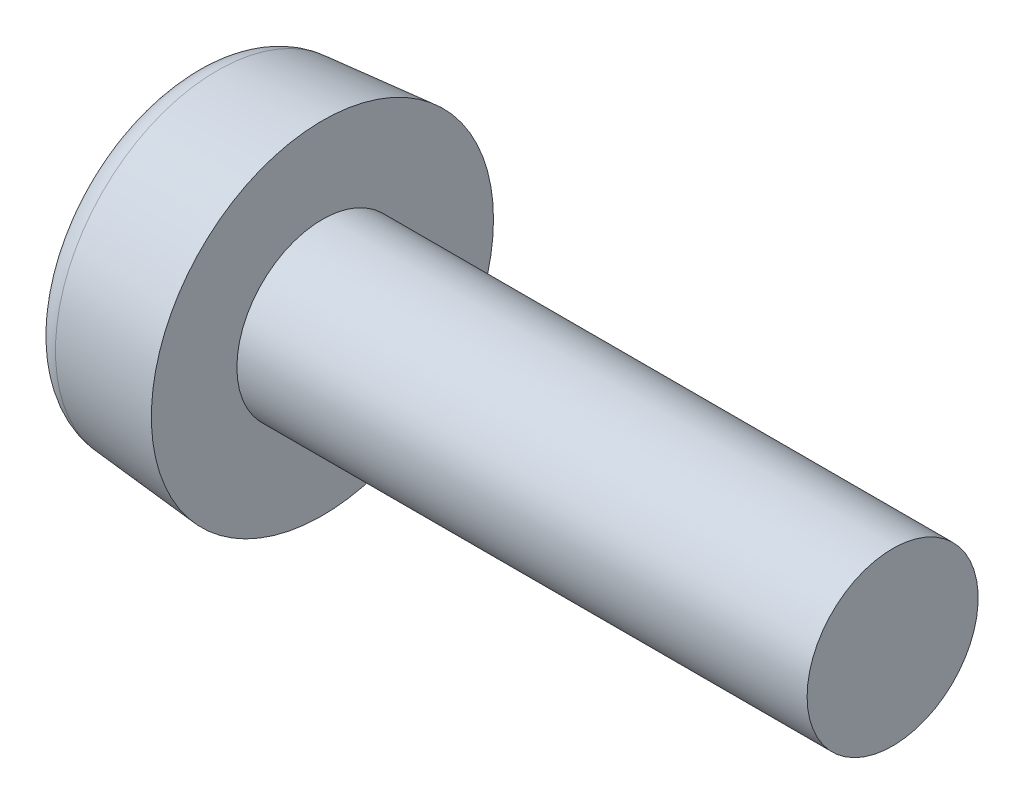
ISO-10303-21;
HEADER;
FILE_DESCRIPTION(('STEP AP214'),'2;1');
FILE_NAME('part.step','',(''),(''),'','','');
FILE_SCHEMA(('AUTOMOTIVE_DESIGN { 1 0 10303 214 1 1 1 1 }'));
ENDSEC;
DATA;
#1=APPLICATION_CONTEXT('core data for automotive mechanical design processes');
#2=APPLICATION_PROTOCOL_DEFINITION('international standard','automotive_design',2000,#1);
#3=PRODUCT_CONTEXT('',#1,'mechanical');
#4=PRODUCT('Part','Part','',(#3));
#5=PRODUCT_RELATED_PRODUCT_CATEGORY('part','',(#4));
#6=PRODUCT_DEFINITION_FORMATION('','',#4);
#7=PRODUCT_DEFINITION_CONTEXT('part definition',#1,'design');
#8=PRODUCT_DEFINITION('design','',#6,#7);
#9=PRODUCT_DEFINITION_SHAPE('','',#8);
#10=(LENGTH_UNIT() NAMED_UNIT(*) SI_UNIT(.MILLI.,.METRE.));
#11=(NAMED_UNIT(*) PLANE_ANGLE_UNIT() SI_UNIT($,.RADIAN.));
#12=(NAMED_UNIT(*) SI_UNIT($,.STERADIAN.) SOLID_ANGLE_UNIT());
#13=UNCERTAINTY_MEASURE_WITH_UNIT(LENGTH_MEASURE(1.E-05),#10,'distance_accuracy_value','');
#14=(GEOMETRIC_REPRESENTATION_CONTEXT(3) GLOBAL_UNCERTAINTY_ASSIGNED_CONTEXT((#13)) GLOBAL_UNIT_ASSIGNED_CONTEXT((#10,
#11,#12)) REPRESENTATION_CONTEXT('',''));
#15=CARTESIAN_POINT('',(0.,0.,0.));
#16=DIRECTION('',(0.,0.,1.));
#17=DIRECTION('',(1.,0.,0.));
#18=AXIS2_PLACEMENT_3D('',#15,#16,#17);
#19=CARTESIAN_POINT('',(0.,0.,0.));
#20=DIRECTION('',(1.,0.,0.));
#21=DIRECTION('',(0.,0.,-1.));
#22=AXIS2_PLACEMENT_3D('',#19,#20,#21);
#23=PLANE('',#22);
#24=CARTESIAN_POINT('',(0.,0.,0.));
#25=DIRECTION('',(1.,0.,0.));
#26=DIRECTION('',(0.,0.,-1.));
#27=AXIS2_PLACEMENT_3D('',#24,#25,#26);
#28=CIRCLE('',#27,4.68122097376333);
#29=CARTESIAN_POINT('',(0.,0.,-4.68122097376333));
#30=VERTEX_POINT('',#29);
#31=EDGE_CURVE('E12',#30,#30,#28,.F.);
#32=ORIENTED_EDGE('',*,*,#31,.T.);
#33=EDGE_LOOP('',(#32));
#34=FACE_BOUND('',#33,.T.);
#35=CARTESIAN_POINT('',(0.,1.73205080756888,-1.));
#36=CARTESIAN_POINT('',(0.,1.95410860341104,-0.615384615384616));
#37=CARTESIAN_POINT('',(0.,2.66469355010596,0.));
#38=CARTESIAN_POINT('',(0.,1.59881613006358,0.923076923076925));
#39=CARTESIAN_POINT('',(0.,1.33234677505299,2.30769230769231));
#40=CARTESIAN_POINT('',(0.,0.,1.84615384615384));
#41=CARTESIAN_POINT('',(0.,-1.33234677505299,2.30769230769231));
#42=CARTESIAN_POINT('',(0.,-1.59881613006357,0.923076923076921));
#43=CARTESIAN_POINT('',(0.,-2.66469355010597,0.));
#44=CARTESIAN_POINT('',(0.,-1.59881613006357,-0.923076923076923));
#45=CARTESIAN_POINT('',(0.,-1.33234677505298,-2.30769230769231));
#46=CARTESIAN_POINT('',(0.,0.,-1.84615384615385));
#47=CARTESIAN_POINT('',(0.,1.33234677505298,-2.30769230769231));
#48=CARTESIAN_POINT('',(0.,1.50999301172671,-1.38461538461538));
#49=CARTESIAN_POINT('',(0.,1.73205080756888,-1.));
#50=B_SPLINE_CURVE_WITH_KNOTS('',3,(#35,#36,#37,#38,#39,#40,#41,#42,#43,#44,#45,#46,#47,#48,
#49),.UNSPECIFIED.,.T.,.F.,(4,1,1,1,1,1,1,1,1,1,1,1,4),(0.,0.0833333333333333,0.166666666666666,
0.25,0.333333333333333,0.416666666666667,0.5,0.583333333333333,0.666666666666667,0.75,
0.833333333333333,0.916666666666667,1.),.UNSPECIFIED.);
#51=CARTESIAN_POINT('',(0.,1.73205080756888,-1.));
#52=VERTEX_POINT('',#51);
#53=EDGE_CURVE('E62',#52,#52,#50,.T.);
#54=ORIENTED_EDGE('',*,*,#53,.T.);
#55=EDGE_LOOP('',(#54));
#56=FACE_BOUND('',#55,.T.);
#57=ADVANCED_FACE('F43',(#34,#56),#23,.F.);
#58=CARTESIAN_POINT('',(4.6,0.,0.));
#59=DIRECTION('',(1.,0.,0.));
#60=DIRECTION('',(0.,0.,-1.));
#61=AXIS2_PLACEMENT_3D('',#58,#59,#60);
#62=PLANE('',#61);
#63=CARTESIAN_POINT('',(4.6,0.,0.));
#64=DIRECTION('',(1.,0.,0.));
#65=DIRECTION('',(0.,0.,-1.));
#66=AXIS2_PLACEMENT_3D('',#63,#64,#65);
#67=CIRCLE('',#66,6.);
#68=CARTESIAN_POINT('',(4.6,0.,-6.));
#69=VERTEX_POINT('',#68);
#70=EDGE_CURVE('E111',#69,#69,#67,.T.);
#71=ORIENTED_EDGE('',*,*,#70,.T.);
#72=EDGE_LOOP('',(#71));
#73=FACE_BOUND('',#72,.T.);
#74=CARTESIAN_POINT('',(4.6,0.,0.));
#75=DIRECTION('',(-1.,0.,0.));
#76=DIRECTION('',(0.,0.,1.));
#77=AXIS2_PLACEMENT_3D('',#74,#75,#76);
#78=CIRCLE('',#77,3.);
#79=CARTESIAN_POINT('',(4.6,0.,3.));
#80=VERTEX_POINT('',#79);
#81=EDGE_CURVE('E65',#80,#80,#78,.T.);
#82=ORIENTED_EDGE('',*,*,#81,.T.);
#83=EDGE_LOOP('',(#82));
#84=FACE_BOUND('',#83,.T.);
#85=ADVANCED_FACE('F98',(#73,#84),#62,.T.);
#86=CARTESIAN_POINT('',(4.6,0.,0.));
#87=DIRECTION('',(1.,0.,0.));
#88=DIRECTION('',(0.,0.,-1.));
#89=AXIS2_PLACEMENT_3D('',#86,#87,#88);
#90=CONICAL_SURFACE('',#89,6.,0.0872664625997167);
#91=CARTESIAN_POINT('',(0.912844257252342,0.,0.));
#92=DIRECTION('',(1.,0.,0.));
#93=DIRECTION('',(0.,0.,-1.));
#94=AXIS2_PLACEMENT_3D('',#91,#92,#93);
#95=CIRCLE('',#94,5.67741567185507);
#96=CARTESIAN_POINT('',(0.912844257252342,0.,-5.67741567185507));
#97=VERTEX_POINT('',#96);
#98=EDGE_CURVE('E50',#97,#97,#95,.T.);
#99=ORIENTED_EDGE('',*,*,#98,.T.);
#100=EDGE_LOOP('',(#99));
#101=FACE_BOUND('',#100,.T.);
#102=ORIENTED_EDGE('',*,*,#70,.F.);
#103=EDGE_LOOP('',(#102));
#104=FACE_BOUND('',#103,.T.);
#105=ADVANCED_FACE('F94',(#101,#104),#90,.T.);
#106=CARTESIAN_POINT('',(24.6,3.,0.));
#107=DIRECTION('',(-1.,0.,0.));
#108=DIRECTION('',(0.,0.,1.));
#109=AXIS2_PLACEMENT_3D('',#106,#107,#108);
#110=PLANE('',#109);
#111=CARTESIAN_POINT('',(24.6,0.,0.));
#112=DIRECTION('',(-1.,0.,0.));
#113=DIRECTION('',(0.,0.,1.));
#114=AXIS2_PLACEMENT_3D('',#111,#112,#113);
#115=CIRCLE('',#114,3.);
#116=CARTESIAN_POINT('',(24.6,0.,3.));
#117=VERTEX_POINT('',#116);
#118=EDGE_CURVE('E113',#117,#117,#115,.T.);
#119=ORIENTED_EDGE('',*,*,#118,.F.);
#120=EDGE_LOOP('',(#119));
#121=FACE_BOUND('',#120,.T.);
#122=ADVANCED_FACE('F90',(#121),#110,.F.);
#123=CARTESIAN_POINT('',(0.,0.,0.));
#124=DIRECTION('',(-1.,0.,0.));
#125=DIRECTION('',(0.,0.,1.));
#126=AXIS2_PLACEMENT_3D('',#123,#124,#125);
#127=CYLINDRICAL_SURFACE('',#126,3.);
#128=ORIENTED_EDGE('',*,*,#81,.F.);
#129=EDGE_LOOP('',(#128));
#130=FACE_BOUND('',#129,.T.);
#131=ORIENTED_EDGE('',*,*,#118,.T.);
#132=EDGE_LOOP('',(#131));
#133=FACE_BOUND('',#132,.T.);
#134=ADVANCED_FACE('F85',(#130,#133),#127,.T.);
#135=CARTESIAN_POINT('',(2.,1.73205080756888,-1.));
#136=CARTESIAN_POINT('',(2.,1.95410860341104,-0.615384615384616));
#137=CARTESIAN_POINT('',(2.,2.66469355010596,0.));
#138=CARTESIAN_POINT('',(2.,1.59881613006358,0.923076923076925));
#139=CARTESIAN_POINT('',(2.,1.33234677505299,2.30769230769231));
#140=CARTESIAN_POINT('',(2.,0.,1.84615384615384));
#141=CARTESIAN_POINT('',(2.,-1.33234677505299,2.30769230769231));
#142=CARTESIAN_POINT('',(2.,-1.59881613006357,0.923076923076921));
#143=CARTESIAN_POINT('',(2.,-2.66469355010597,0.));
#144=CARTESIAN_POINT('',(2.,-1.59881613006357,-0.923076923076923));
#145=CARTESIAN_POINT('',(2.,-1.33234677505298,-2.30769230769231));
#146=CARTESIAN_POINT('',(2.,0.,-1.84615384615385));
#147=CARTESIAN_POINT('',(2.,1.33234677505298,-2.30769230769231));
#148=CARTESIAN_POINT('',(2.,1.50999301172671,-1.38461538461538));
#149=CARTESIAN_POINT('',(2.,1.73205080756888,-1.));
#150=B_SPLINE_CURVE_WITH_KNOTS('',3,(#135,#136,#137,#138,#139,#140,#141,#142,#143,#144,#145,
#146,#147,#148,#149),.UNSPECIFIED.,.T.,.F.,(4,1,1,1,1,1,1,1,1,1,1,1,4),(0.,0.0833333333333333,
0.166666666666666,0.25,0.333333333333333,0.416666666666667,0.5,0.583333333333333,
0.666666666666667,0.75,0.833333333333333,0.916666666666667,1.),.UNSPECIFIED.);
#151=DIRECTION('',(-1.,0.,0.));
#152=VECTOR('',#151,1.);
#153=SURFACE_OF_LINEAR_EXTRUSION('',#150,#152);
#154=CARTESIAN_POINT('',(2.,1.73205080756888,-1.));
#155=CARTESIAN_POINT('',(2.,1.50999301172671,-1.38461538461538));
#156=CARTESIAN_POINT('',(2.,1.33234677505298,-2.30769230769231));
#157=CARTESIAN_POINT('',(2.,0.,-1.84615384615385));
#158=CARTESIAN_POINT('',(2.,-1.33234677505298,-2.30769230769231));
#159=CARTESIAN_POINT('',(2.,-1.59881613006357,-0.923076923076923));
#160=CARTESIAN_POINT('',(2.,-2.66469355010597,0.));
#161=CARTESIAN_POINT('',(2.,-1.59881613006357,0.923076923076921));
#162=CARTESIAN_POINT('',(2.,-1.33234677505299,2.30769230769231));
#163=CARTESIAN_POINT('',(2.,0.,1.84615384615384));
#164=CARTESIAN_POINT('',(2.,1.33234677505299,2.30769230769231));
#165=CARTESIAN_POINT('',(2.,1.59881613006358,0.923076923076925));
#166=CARTESIAN_POINT('',(2.,2.66469355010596,0.));
#167=CARTESIAN_POINT('',(2.,1.95410860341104,-0.615384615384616));
#168=CARTESIAN_POINT('',(2.,1.73205080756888,-1.));
#169=B_SPLINE_CURVE_WITH_KNOTS('',3,(#154,#155,#156,#157,#158,#159,#160,#161,#162,#163,#164,
#165,#166,#167,#168),.UNSPECIFIED.,.T.,.F.,(4,1,1,1,1,1,1,1,1,1,1,1,4),(0.,0.0833333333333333,
0.166666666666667,0.25,0.333333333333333,0.416666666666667,0.5,0.583333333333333,
0.666666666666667,0.75,0.833333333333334,0.916666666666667,1.),.UNSPECIFIED.);
#170=CARTESIAN_POINT('',(2.,1.73205080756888,-1.));
#171=VERTEX_POINT('',#170);
#172=EDGE_CURVE('E60',#171,#171,#169,.T.);
#173=ORIENTED_EDGE('',*,*,#172,.F.);
#174=EDGE_LOOP('',(#173));
#175=FACE_BOUND('',#174,.T.);
#176=ORIENTED_EDGE('',*,*,#53,.F.);
#177=EDGE_LOOP('',(#176));
#178=FACE_BOUND('',#177,.T.);
#179=ADVANCED_FACE('F56',(#175,#178),#153,.T.);
#180=CARTESIAN_POINT('',(2.66666666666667,0.,0.));
#181=CARTESIAN_POINT('',(2.,1.73205080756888,-1.));
#182=CARTESIAN_POINT('',(2.66666666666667,0.,0.));
#183=CARTESIAN_POINT('',(2.,1.50999301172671,-1.38461538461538));
#184=CARTESIAN_POINT('',(2.66666666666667,0.,0.));
#185=CARTESIAN_POINT('',(2.,1.33234677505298,-2.30769230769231));
#186=CARTESIAN_POINT('',(2.66666666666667,0.,0.));
#187=CARTESIAN_POINT('',(2.,0.,-1.84615384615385));
#188=CARTESIAN_POINT('',(2.66666666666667,0.,0.));
#189=CARTESIAN_POINT('',(2.,-1.33234677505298,-2.30769230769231));
#190=CARTESIAN_POINT('',(2.66666666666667,0.,0.));
#191=CARTESIAN_POINT('',(2.,-1.59881613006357,-0.923076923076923));
#192=CARTESIAN_POINT('',(2.66666666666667,0.,0.));
#193=CARTESIAN_POINT('',(2.,-2.66469355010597,0.));
#194=CARTESIAN_POINT('',(2.66666666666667,0.,0.));
#195=CARTESIAN_POINT('',(2.,-1.59881613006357,0.923076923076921));
#196=CARTESIAN_POINT('',(2.66666666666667,0.,0.));
#197=CARTESIAN_POINT('',(2.,-1.33234677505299,2.30769230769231));
#198=CARTESIAN_POINT('',(2.66666666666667,0.,0.));
#199=CARTESIAN_POINT('',(2.,0.,1.84615384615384));
#200=CARTESIAN_POINT('',(2.66666666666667,0.,0.));
#201=CARTESIAN_POINT('',(2.,1.33234677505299,2.30769230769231));
#202=CARTESIAN_POINT('',(2.66666666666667,0.,0.));
#203=CARTESIAN_POINT('',(2.,1.59881613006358,0.923076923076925));
#204=CARTESIAN_POINT('',(2.66666666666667,0.,0.));
#205=CARTESIAN_POINT('',(2.,2.66469355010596,0.));
#206=CARTESIAN_POINT('',(2.66666666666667,0.,0.));
#207=CARTESIAN_POINT('',(2.,1.95410860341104,-0.615384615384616));
#208=CARTESIAN_POINT('',(2.66666666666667,0.,0.));
#209=CARTESIAN_POINT('',(2.,1.73205080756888,-1.));
#210=B_SPLINE_SURFACE_WITH_KNOTS('',3,1,((#180,#181),(#182,#183),(#184,#185),(#186,#187),(#188,
#189),(#190,#191),(#192,#193),(#194,#195),(#196,#197),(#198,#199),(#200,#201),(#202,#203),(#204,
#205),(#206,#207),(#208,#209)),.UNSPECIFIED.,.T.,.F.,.F.,(4,1,1,1,1,1,1,1,1,1,1,1,4),(2,2),(0.,
0.0833333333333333,0.166666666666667,0.25,0.333333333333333,0.416666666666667,0.5,
0.583333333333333,0.666666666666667,0.75,0.833333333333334,0.916666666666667,1.),(0.,1.),.UNSPECIFIED.);
#211=CARTESIAN_POINT('',(2.66666666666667,0.,0.));
#212=VERTEX_POINT('',#211);
#213=VERTEX_LOOP('',#212);
#214=FACE_BOUND('',#213,.T.);
#215=ORIENTED_EDGE('',*,*,#172,.T.);
#216=EDGE_LOOP('',(#215));
#217=FACE_BOUND('',#216,.T.);
#218=ADVANCED_FACE('F53',(#214,#217),#210,.F.);
#219=CARTESIAN_POINT('',(1.,0.,0.));
#220=DIRECTION('',(1.,0.,0.));
#221=DIRECTION('',(0.,0.,-1.));
#222=AXIS2_PLACEMENT_3D('',#219,#220,#221);
#223=TOROIDAL_SURFACE('',#222,4.68122097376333,1.);
#224=ORIENTED_EDGE('',*,*,#31,.F.);
#225=EDGE_LOOP('',(#224));
#226=FACE_BOUND('',#225,.T.);
#227=ORIENTED_EDGE('',*,*,#98,.F.);
#228=EDGE_LOOP('',(#227));
#229=FACE_BOUND('',#228,.T.);
#230=ADVANCED_FACE('F45',(#226,#229),#223,.T.);
#231=CLOSED_SHELL('',(#57,#85,#105,#122,#134,#179,#218,#230));
#232=MANIFOLD_SOLID_BREP('B2',#231);
#233=ADVANCED_BREP_SHAPE_REPRESENTATION('',(#18,#232),#14);
#234=SHAPE_DEFINITION_REPRESENTATION(#9,#233);
ENDSEC;
END-ISO-10303-21;
